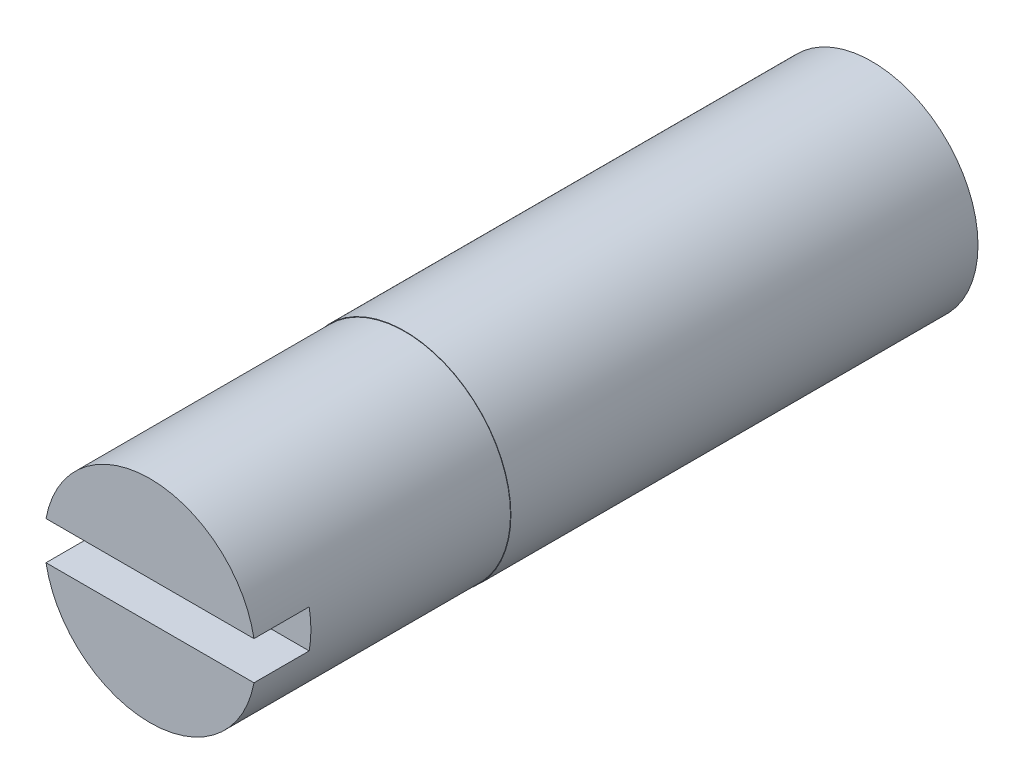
ISO-10303-21;
HEADER;
FILE_DESCRIPTION(('STEP AP214'),'2;1');
FILE_NAME('part.step','',(''),(''),'','','');
FILE_SCHEMA(('AUTOMOTIVE_DESIGN { 1 0 10303 214 1 1 1 1 }'));
ENDSEC;
DATA;
#1=APPLICATION_CONTEXT('core data for automotive mechanical design processes');
#2=APPLICATION_PROTOCOL_DEFINITION('international standard','automotive_design',2000,#1);
#3=PRODUCT_CONTEXT('',#1,'mechanical');
#4=PRODUCT('Part','Part','',(#3));
#5=PRODUCT_RELATED_PRODUCT_CATEGORY('part','',(#4));
#6=PRODUCT_DEFINITION_FORMATION('','',#4);
#7=PRODUCT_DEFINITION_CONTEXT('part definition',#1,'design');
#8=PRODUCT_DEFINITION('design','',#6,#7);
#9=PRODUCT_DEFINITION_SHAPE('','',#8);
#10=(LENGTH_UNIT() NAMED_UNIT(*) SI_UNIT(.MILLI.,.METRE.));
#11=(NAMED_UNIT(*) PLANE_ANGLE_UNIT() SI_UNIT($,.RADIAN.));
#12=(NAMED_UNIT(*) SI_UNIT($,.STERADIAN.) SOLID_ANGLE_UNIT());
#13=UNCERTAINTY_MEASURE_WITH_UNIT(LENGTH_MEASURE(1.E-05),#10,'distance_accuracy_value','');
#14=(GEOMETRIC_REPRESENTATION_CONTEXT(3) GLOBAL_UNCERTAINTY_ASSIGNED_CONTEXT((#13)) GLOBAL_UNIT_ASSIGNED_CONTEXT((#10,
#11,#12)) REPRESENTATION_CONTEXT('',''));
#15=CARTESIAN_POINT('',(0.,0.,0.));
#16=DIRECTION('',(0.,0.,1.));
#17=DIRECTION('',(1.,0.,0.));
#18=AXIS2_PLACEMENT_3D('',#15,#16,#17);
#19=CARTESIAN_POINT('',(0.,0.,6.));
#20=DIRECTION('',(0.,0.,1.));
#21=DIRECTION('',(1.,0.,0.));
#22=AXIS2_PLACEMENT_3D('',#19,#20,#21);
#23=PLANE('',#22);
#24=DIRECTION('',(1.,0.,0.));
#25=VECTOR('',#24,1.);
#26=CARTESIAN_POINT('',(0.,-0.45,6.));
#27=LINE('',#26,#25);
#28=CARTESIAN_POINT('',(-2.44899979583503,-0.45,6.));
#29=VERTEX_POINT('',#28);
#30=CARTESIAN_POINT('',(2.44899979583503,-0.45,6.));
#31=VERTEX_POINT('',#30);
#32=EDGE_CURVE('E110',#29,#31,#27,.T.);
#33=ORIENTED_EDGE('',*,*,#32,.F.);
#34=CARTESIAN_POINT('',(0.,0.,6.));
#35=DIRECTION('',(0.,0.,1.));
#36=DIRECTION('',(1.,0.,0.));
#37=AXIS2_PLACEMENT_3D('',#34,#35,#36);
#38=CIRCLE('',#37,2.49);
#39=EDGE_CURVE('E121',#29,#31,#38,.T.);
#40=ORIENTED_EDGE('',*,*,#39,.T.);
#41=EDGE_LOOP('',(#33,#40));
#42=FACE_BOUND('',#41,.T.);
#43=ADVANCED_FACE('F63',(#42),#23,.T.);
#44=CARTESIAN_POINT('',(0.,0.,6.));
#45=DIRECTION('',(0.,0.,-1.));
#46=DIRECTION('',(-1.,0.,0.));
#47=AXIS2_PLACEMENT_3D('',#44,#45,#46);
#48=CYLINDRICAL_SURFACE('',#47,2.49);
#49=ORIENTED_EDGE('',*,*,#39,.F.);
#50=DIRECTION('',(0.,0.,-1.));
#51=VECTOR('',#50,1.);
#52=CARTESIAN_POINT('',(-2.44899979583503,-0.45,6.));
#53=LINE('',#52,#51);
#54=CARTESIAN_POINT('',(-2.44899979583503,-0.45,4.7));
#55=VERTEX_POINT('',#54);
#56=EDGE_CURVE('E124',#29,#55,#53,.T.);
#57=ORIENTED_EDGE('',*,*,#56,.T.);
#58=CARTESIAN_POINT('',(0.,0.,4.7));
#59=DIRECTION('',(0.,0.,1.));
#60=DIRECTION('',(1.,0.,0.));
#61=AXIS2_PLACEMENT_3D('',#58,#59,#60);
#62=CIRCLE('',#61,2.49);
#63=CARTESIAN_POINT('',(-2.44899979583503,0.45,4.7));
#64=VERTEX_POINT('',#63);
#65=EDGE_CURVE('E12',#64,#55,#62,.T.);
#66=ORIENTED_EDGE('',*,*,#65,.F.);
#67=DIRECTION('',(0.,0.,-1.));
#68=VECTOR('',#67,1.);
#69=CARTESIAN_POINT('',(-2.44899979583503,0.45,6.));
#70=LINE('',#69,#68);
#71=CARTESIAN_POINT('',(-2.44899979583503,0.45,6.));
#72=VERTEX_POINT('',#71);
#73=EDGE_CURVE('E105',#64,#72,#70,.F.);
#74=ORIENTED_EDGE('',*,*,#73,.T.);
#75=CARTESIAN_POINT('',(2.44899979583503,0.45,6.));
#76=VERTEX_POINT('',#75);
#77=EDGE_CURVE('E111',#76,#72,#38,.T.);
#78=ORIENTED_EDGE('',*,*,#77,.F.);
#79=DIRECTION('',(0.,0.,-1.));
#80=VECTOR('',#79,1.);
#81=CARTESIAN_POINT('',(2.44899979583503,0.45,6.));
#82=LINE('',#81,#80);
#83=CARTESIAN_POINT('',(2.44899979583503,0.45,4.7));
#84=VERTEX_POINT('',#83);
#85=EDGE_CURVE('E78',#76,#84,#82,.T.);
#86=ORIENTED_EDGE('',*,*,#85,.T.);
#87=CARTESIAN_POINT('',(2.44899979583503,-0.45,4.7));
#88=VERTEX_POINT('',#87);
#89=EDGE_CURVE('E67',#88,#84,#62,.T.);
#90=ORIENTED_EDGE('',*,*,#89,.F.);
#91=DIRECTION('',(0.,0.,-1.));
#92=VECTOR('',#91,1.);
#93=CARTESIAN_POINT('',(2.44899979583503,-0.45,6.));
#94=LINE('',#93,#92);
#95=EDGE_CURVE('E86',#88,#31,#94,.F.);
#96=ORIENTED_EDGE('',*,*,#95,.T.);
#97=EDGE_LOOP('',(#49,#57,#66,#74,#78,#86,#90,#96));
#98=FACE_BOUND('',#97,.T.);
#99=CARTESIAN_POINT('',(0.,0.,0.));
#100=DIRECTION('',(0.,0.,1.));
#101=DIRECTION('',(1.,0.,0.));
#102=AXIS2_PLACEMENT_3D('',#99,#100,#101);
#103=CIRCLE('',#102,2.49);
#104=CARTESIAN_POINT('',(2.49,0.,0.));
#105=VERTEX_POINT('',#104);
#106=EDGE_CURVE('E128',#105,#105,#103,.T.);
#107=ORIENTED_EDGE('',*,*,#106,.T.);
#108=EDGE_LOOP('',(#107));
#109=FACE_BOUND('',#108,.T.);
#110=ADVANCED_FACE('F65',(#98,#109),#48,.T.);
#111=DIRECTION('',(-1.,0.,0.));
#112=VECTOR('',#111,1.);
#113=CARTESIAN_POINT('',(0.,0.45,6.));
#114=LINE('',#113,#112);
#115=EDGE_CURVE('E102',#76,#72,#114,.T.);
#116=ORIENTED_EDGE('',*,*,#115,.F.);
#117=ORIENTED_EDGE('',*,*,#77,.T.);
#118=EDGE_LOOP('',(#116,#117));
#119=FACE_BOUND('',#118,.T.);
#120=ADVANCED_FACE('F120',(#119),#23,.T.);
#121=CARTESIAN_POINT('',(0.,0.,4.7));
#122=DIRECTION('',(0.,0.,1.));
#123=DIRECTION('',(1.,0.,0.));
#124=AXIS2_PLACEMENT_3D('',#121,#122,#123);
#125=PLANE('',#124);
#126=ORIENTED_EDGE('',*,*,#65,.T.);
#127=DIRECTION('',(1.,0.,0.));
#128=VECTOR('',#127,1.);
#129=CARTESIAN_POINT('',(0.,-0.45,4.7));
#130=LINE('',#129,#128);
#131=EDGE_CURVE('E118',#55,#88,#130,.T.);
#132=ORIENTED_EDGE('',*,*,#131,.T.);
#133=ORIENTED_EDGE('',*,*,#89,.T.);
#134=DIRECTION('',(-1.,0.,0.));
#135=VECTOR('',#134,1.);
#136=CARTESIAN_POINT('',(0.,0.45,4.7));
#137=LINE('',#136,#135);
#138=EDGE_CURVE('E130',#84,#64,#137,.T.);
#139=ORIENTED_EDGE('',*,*,#138,.T.);
#140=EDGE_LOOP('',(#126,#132,#133,#139));
#141=FACE_BOUND('',#140,.T.);
#142=ADVANCED_FACE('F135',(#141),#125,.T.);
#143=CARTESIAN_POINT('',(0.,-0.45,4.7));
#144=DIRECTION('',(0.,-1.,0.));
#145=DIRECTION('',(1.,0.,0.));
#146=AXIS2_PLACEMENT_3D('',#143,#144,#145);
#147=PLANE('',#146);
#148=ORIENTED_EDGE('',*,*,#32,.T.);
#149=ORIENTED_EDGE('',*,*,#95,.F.);
#150=ORIENTED_EDGE('',*,*,#131,.F.);
#151=ORIENTED_EDGE('',*,*,#56,.F.);
#152=EDGE_LOOP('',(#148,#149,#150,#151));
#153=FACE_BOUND('',#152,.T.);
#154=ADVANCED_FACE('F173',(#153),#147,.F.);
#155=CARTESIAN_POINT('',(0.,0.45,4.7));
#156=DIRECTION('',(0.,1.,0.));
#157=DIRECTION('',(-1.,0.,0.));
#158=AXIS2_PLACEMENT_3D('',#155,#156,#157);
#159=PLANE('',#158);
#160=ORIENTED_EDGE('',*,*,#115,.T.);
#161=ORIENTED_EDGE('',*,*,#73,.F.);
#162=ORIENTED_EDGE('',*,*,#138,.F.);
#163=ORIENTED_EDGE('',*,*,#85,.F.);
#164=EDGE_LOOP('',(#160,#161,#162,#163));
#165=FACE_BOUND('',#164,.T.);
#166=ADVANCED_FACE('F104',(#165),#159,.F.);
#167=CARTESIAN_POINT('',(0.,0.,-11.));
#168=DIRECTION('',(0.,0.,1.));
#169=DIRECTION('',(1.,0.,0.));
#170=AXIS2_PLACEMENT_3D('',#167,#168,#169);
#171=CYLINDRICAL_SURFACE('',#170,2.5);
#172=CARTESIAN_POINT('',(0.,0.,-11.));
#173=DIRECTION('',(0.,0.,-1.));
#174=DIRECTION('',(-1.,0.,0.));
#175=AXIS2_PLACEMENT_3D('',#172,#173,#174);
#176=CIRCLE('',#175,2.5);
#177=CARTESIAN_POINT('',(-2.5,0.,-11.));
#178=VERTEX_POINT('',#177);
#179=EDGE_CURVE('E131',#178,#178,#176,.T.);
#180=ORIENTED_EDGE('',*,*,#179,.F.);
#181=EDGE_LOOP('',(#180));
#182=FACE_BOUND('',#181,.T.);
#183=CARTESIAN_POINT('',(0.,0.,0.));
#184=DIRECTION('',(0.,0.,-1.));
#185=DIRECTION('',(-1.,0.,0.));
#186=AXIS2_PLACEMENT_3D('',#183,#184,#185);
#187=CIRCLE('',#186,2.5);
#188=CARTESIAN_POINT('',(-2.5,0.,0.));
#189=VERTEX_POINT('',#188);
#190=EDGE_CURVE('E140',#189,#189,#187,.T.);
#191=ORIENTED_EDGE('',*,*,#190,.T.);
#192=EDGE_LOOP('',(#191));
#193=FACE_BOUND('',#192,.T.);
#194=ADVANCED_FACE('F148',(#182,#193),#171,.T.);
#195=CARTESIAN_POINT('',(0.,0.,-11.));
#196=DIRECTION('',(0.,0.,-1.));
#197=DIRECTION('',(-1.,0.,0.));
#198=AXIS2_PLACEMENT_3D('',#195,#196,#197);
#199=PLANE('',#198);
#200=ORIENTED_EDGE('',*,*,#179,.T.);
#201=EDGE_LOOP('',(#200));
#202=FACE_BOUND('',#201,.T.);
#203=ADVANCED_FACE('F146',(#202),#199,.T.);
#204=CARTESIAN_POINT('',(0.,0.,0.));
#205=DIRECTION('',(0.,0.,-1.));
#206=DIRECTION('',(-1.,0.,0.));
#207=AXIS2_PLACEMENT_3D('',#204,#205,#206);
#208=PLANE('',#207);
#209=ORIENTED_EDGE('',*,*,#106,.F.);
#210=EDGE_LOOP('',(#209));
#211=FACE_BOUND('',#210,.T.);
#212=ORIENTED_EDGE('',*,*,#190,.F.);
#213=EDGE_LOOP('',(#212));
#214=FACE_BOUND('',#213,.T.);
#215=ADVANCED_FACE('F154',(#211,#214),#208,.F.);
#216=CLOSED_SHELL('',(#43,#110,#120,#142,#154,#166,#194,#203,#215));
#217=MANIFOLD_SOLID_BREP('B2',#216);
#218=ADVANCED_BREP_SHAPE_REPRESENTATION('',(#18,#217),#14);
#219=SHAPE_DEFINITION_REPRESENTATION(#9,#218);
ENDSEC;
END-ISO-10303-21;
